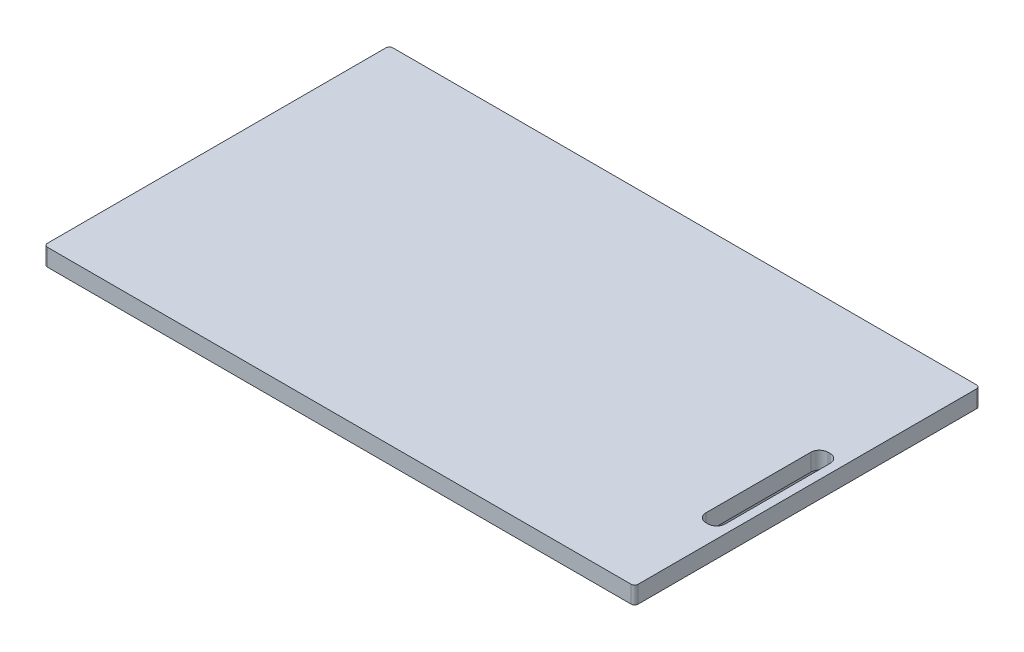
from build123d import *

# Parameters (mm, degrees)
ESQUISSE1_W             = 200
ESQUISSE1_H             = 342
BOSS_EXTRU_1_DEPTH      = 19
ENL_V_MAT_EXTRU_1_REACH = 201.003
ESQUISSE2_W             = 11.2
ESQUISSE2_H             = 70.7
CONG_1_R                = 5
ESQUISSE4_W             = 342
ESQUISSE4_H             = 200
ESQUISSE4_W_2           = 303
ESQUISSE4_H_2           = 139
ENL_V_MAT_EXTRU_2_DEPTH = 9
CONG_3_R                = 2


with BuildPart() as part:
    # Esquisse1 → Boss.-Extru.1 (new body)
    with BuildSketch(Plane(origin=(0, 0, 0), x_dir=(0, 0, -1), z_dir=(0, 1, 0))):
        Rectangle(ESQUISSE1_W, ESQUISSE1_H)
    extrude(amount=BOSS_EXTRU_1_DEPTH)

    # Esquisse2 → Enl_v. mat.-Extru.1 (cut, up to next)
    with BuildSketch(Plane(origin=(0, 19, 0), x_dir=(1, 0, 0), z_dir=(0, 1, 0)), mode=Mode.PRIVATE) as enl_v_mat_extru_1_sk1:
        with Locations((160.4, -12.15)):
            Rectangle(ESQUISSE2_W, ESQUISSE2_H)
    enl_v_mat_extru_1_tool1 = extrude(enl_v_mat_extru_1_sk1.sketch, amount=-ENL_V_MAT_EXTRU_1_REACH, mode=Mode.PRIVATE) & part.part
    add(enl_v_mat_extru_1_tool1.solids().sort_by_distance((160.4, 19, 12.15))[0], mode=Mode.SUBTRACT)

    # Cong_1
    cong_1_edges = [part.edges().sort_by_distance(p)[0] for p in [
        (154.8, 9.5, 47.5),
        (154.8, 9.5, -23.2),
        (166, 9.5, -23.2),
        (166, 9.5, 47.5),
    ]]
    fillet(cong_1_edges, radius=CONG_1_R)

    # Esquisse4 → Enl_v. mat.-Extru.2 (cut)
    with BuildSketch(Plane.XZ):
        Rectangle(ESQUISSE4_W, ESQUISSE4_H)
        with Locations((0, 11)):
            Rectangle(ESQUISSE4_W_2, ESQUISSE4_H_2, mode=Mode.SUBTRACT)
    extrude(amount=-ENL_V_MAT_EXTRU_2_DEPTH, mode=Mode.SUBTRACT)

    # Cong_3
    cong_3_edges = [part.edges().sort_by_distance(p)[0] for p in [
        (-151.5, 4.5, 80.5),
        (151.5, 4.5, 80.5),
        (151.5, 4.5, -58.5),
        (-151.5, 4.5, -58.5),
        (171, 14, -100),
        (171, 14, 100),
        (-171, 14, 100),
        (-171, 14, -100),
    ]]
    fillet(cong_3_edges, radius=CONG_3_R)


solid = part.part
